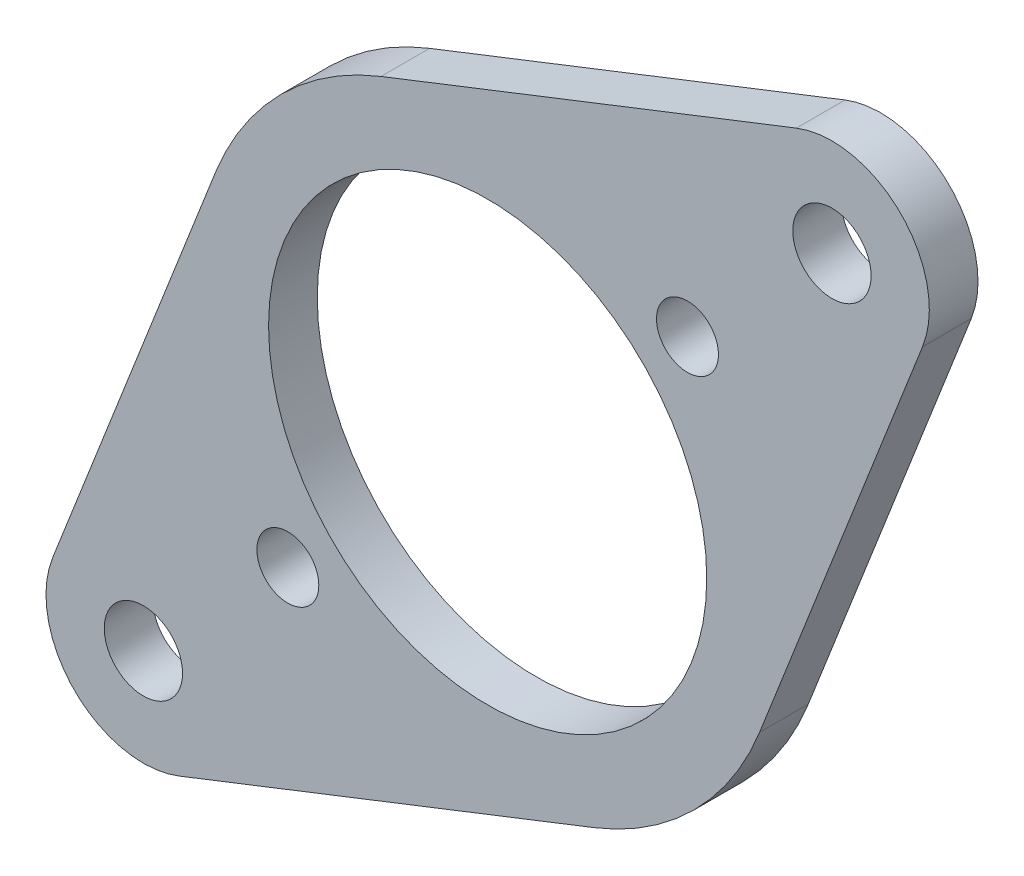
ISO-10303-21;
HEADER;
FILE_DESCRIPTION(('STEP AP214'),'2;1');
FILE_NAME('part.step','',(''),(''),'','','');
FILE_SCHEMA(('AUTOMOTIVE_DESIGN { 1 0 10303 214 1 1 1 1 }'));
ENDSEC;
DATA;
#1=APPLICATION_CONTEXT('core data for automotive mechanical design processes');
#2=APPLICATION_PROTOCOL_DEFINITION('international standard','automotive_design',2000,#1);
#3=PRODUCT_CONTEXT('',#1,'mechanical');
#4=PRODUCT('Part','Part','',(#3));
#5=PRODUCT_RELATED_PRODUCT_CATEGORY('part','',(#4));
#6=PRODUCT_DEFINITION_FORMATION('','',#4);
#7=PRODUCT_DEFINITION_CONTEXT('part definition',#1,'design');
#8=PRODUCT_DEFINITION('design','',#6,#7);
#9=PRODUCT_DEFINITION_SHAPE('','',#8);
#10=(LENGTH_UNIT() NAMED_UNIT(*) SI_UNIT(.MILLI.,.METRE.));
#11=(NAMED_UNIT(*) PLANE_ANGLE_UNIT() SI_UNIT($,.RADIAN.));
#12=(NAMED_UNIT(*) SI_UNIT($,.STERADIAN.) SOLID_ANGLE_UNIT());
#13=UNCERTAINTY_MEASURE_WITH_UNIT(LENGTH_MEASURE(1.E-05),#10,'distance_accuracy_value','');
#14=(GEOMETRIC_REPRESENTATION_CONTEXT(3) GLOBAL_UNCERTAINTY_ASSIGNED_CONTEXT((#13)) GLOBAL_UNIT_ASSIGNED_CONTEXT((#10,
#11,#12)) REPRESENTATION_CONTEXT('',''));
#15=CARTESIAN_POINT('',(0.,0.,0.));
#16=DIRECTION('',(0.,0.,1.));
#17=DIRECTION('',(1.,0.,0.));
#18=AXIS2_PLACEMENT_3D('',#15,#16,#17);
#19=CARTESIAN_POINT('',(0.,0.,3.175));
#20=DIRECTION('',(0.,0.,1.));
#21=DIRECTION('',(1.,0.,0.));
#22=AXIS2_PLACEMENT_3D('',#19,#20,#21);
#23=PLANE('',#22);
#24=CARTESIAN_POINT('',(-13.0303516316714,-13.0303516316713,3.175));
#25=DIRECTION('',(0.,0.,1.));
#26=DIRECTION('',(1.,0.,0.));
#27=AXIS2_PLACEMENT_3D('',#24,#25,#26);
#28=CIRCLE('',#27,2.0193);
#29=CARTESIAN_POINT('',(-11.0110516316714,-13.0303516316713,3.175));
#30=VERTEX_POINT('',#29);
#31=EDGE_CURVE('E193',#30,#30,#28,.T.);
#32=ORIENTED_EDGE('',*,*,#31,.F.);
#33=EDGE_LOOP('',(#32));
#34=FACE_BOUND('',#33,.T.);
#35=CARTESIAN_POINT('',(22.450640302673,22.4506403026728,3.175));
#36=DIRECTION('',(0.,0.,1.));
#37=DIRECTION('',(1.,0.,0.));
#38=AXIS2_PLACEMENT_3D('',#35,#36,#37);
#39=CIRCLE('',#38,2.5527);
#40=CARTESIAN_POINT('',(25.003340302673,22.4506403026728,3.175));
#41=VERTEX_POINT('',#40);
#42=EDGE_CURVE('E181',#41,#41,#39,.T.);
#43=ORIENTED_EDGE('',*,*,#42,.F.);
#44=EDGE_LOOP('',(#43));
#45=FACE_BOUND('',#44,.T.);
#46=CARTESIAN_POINT('',(0.,0.,3.175));
#47=DIRECTION('',(0.,0.,1.));
#48=DIRECTION('',(1.,0.,0.));
#49=AXIS2_PLACEMENT_3D('',#46,#47,#48);
#50=CIRCLE('',#49,19.05);
#51=CARTESIAN_POINT('',(6.9576573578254,-17.7339647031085,3.175));
#52=VERTEX_POINT('',#51);
#53=CARTESIAN_POINT('',(17.7339647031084,-6.95765735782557,3.175));
#54=VERTEX_POINT('',#53);
#55=EDGE_CURVE('E144',#52,#54,#50,.T.);
#56=ORIENTED_EDGE('',*,*,#55,.T.);
#57=DIRECTION('',(0.365231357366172,0.930916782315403,0.));
#58=VECTOR('',#57,1.);
#59=CARTESIAN_POINT('',(28.3619618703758,20.1314211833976,3.175));
#60=LINE('',#59,#58);
#61=CARTESIAN_POINT('',(28.3619618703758,20.1314211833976,3.175));
#62=VERTEX_POINT('',#61);
#63=EDGE_CURVE('E92',#54,#62,#60,.T.);
#64=ORIENTED_EDGE('',*,*,#63,.T.);
#65=CARTESIAN_POINT('',(22.450640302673,22.4506403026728,3.175));
#66=DIRECTION('',(0.,0.,1.));
#67=DIRECTION('',(1.,0.,0.));
#68=AXIS2_PLACEMENT_3D('',#65,#66,#67);
#69=CIRCLE('',#68,6.35);
#70=CARTESIAN_POINT('',(20.1314211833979,28.3619618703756,3.175));
#71=VERTEX_POINT('',#70);
#72=EDGE_CURVE('E159',#62,#71,#69,.T.);
#73=ORIENTED_EDGE('',*,*,#72,.T.);
#74=DIRECTION('',(-0.930916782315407,-0.365231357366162,0.));
#75=VECTOR('',#74,1.);
#76=CARTESIAN_POINT('',(-6.95765735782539,17.7339647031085,3.175));
#77=LINE('',#76,#75);
#78=CARTESIAN_POINT('',(-6.95765735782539,17.7339647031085,3.175));
#79=VERTEX_POINT('',#78);
#80=EDGE_CURVE('E172',#71,#79,#77,.T.);
#81=ORIENTED_EDGE('',*,*,#80,.T.);
#82=CARTESIAN_POINT('',(0.,0.,3.175));
#83=DIRECTION('',(0.,0.,1.));
#84=DIRECTION('',(1.,0.,0.));
#85=AXIS2_PLACEMENT_3D('',#82,#83,#84);
#86=CIRCLE('',#85,19.05);
#87=CARTESIAN_POINT('',(-17.7339647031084,6.95765735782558,3.175));
#88=VERTEX_POINT('',#87);
#89=EDGE_CURVE('E111',#79,#88,#86,.T.);
#90=ORIENTED_EDGE('',*,*,#89,.T.);
#91=DIRECTION('',(-0.365231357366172,-0.930916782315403,0.));
#92=VECTOR('',#91,1.);
#93=CARTESIAN_POINT('',(-17.7339647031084,6.95765735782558,3.175));
#94=LINE('',#93,#92);
#95=CARTESIAN_POINT('',(-28.3619618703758,-20.1314211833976,3.175));
#96=VERTEX_POINT('',#95);
#97=EDGE_CURVE('E105',#88,#96,#94,.T.);
#98=ORIENTED_EDGE('',*,*,#97,.T.);
#99=CARTESIAN_POINT('',(-22.450640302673,-22.4506403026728,3.175));
#100=DIRECTION('',(0.,0.,1.));
#101=DIRECTION('',(1.,0.,0.));
#102=AXIS2_PLACEMENT_3D('',#99,#100,#101);
#103=CIRCLE('',#102,6.35000000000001);
#104=CARTESIAN_POINT('',(-20.1314211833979,-28.3619618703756,3.175));
#105=VERTEX_POINT('',#104);
#106=EDGE_CURVE('E109',#96,#105,#103,.T.);
#107=ORIENTED_EDGE('',*,*,#106,.T.);
#108=DIRECTION('',(0.930916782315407,0.365231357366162,0.));
#109=VECTOR('',#108,1.);
#110=CARTESIAN_POINT('',(-20.1314211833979,-28.3619618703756,3.175));
#111=LINE('',#110,#109);
#112=EDGE_CURVE('E49',#105,#52,#111,.T.);
#113=ORIENTED_EDGE('',*,*,#112,.T.);
#114=EDGE_LOOP('',(#56,#64,#73,#81,#90,#98,#107,#113));
#115=FACE_BOUND('',#114,.T.);
#116=CARTESIAN_POINT('',(0.,0.,3.175));
#117=DIRECTION('',(0.,0.,1.));
#118=DIRECTION('',(1.,0.,0.));
#119=AXIS2_PLACEMENT_3D('',#116,#117,#118);
#120=CIRCLE('',#119,14.2875);
#121=CARTESIAN_POINT('',(14.2875,0.,3.175));
#122=VERTEX_POINT('',#121);
#123=EDGE_CURVE('E133',#122,#122,#120,.T.);
#124=ORIENTED_EDGE('',*,*,#123,.F.);
#125=EDGE_LOOP('',(#124));
#126=FACE_BOUND('',#125,.T.);
#127=CARTESIAN_POINT('',(-22.450640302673,-22.4506403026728,3.175));
#128=DIRECTION('',(0.,0.,1.));
#129=DIRECTION('',(1.,0.,0.));
#130=AXIS2_PLACEMENT_3D('',#127,#128,#129);
#131=CIRCLE('',#130,2.5527);
#132=CARTESIAN_POINT('',(-19.897940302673,-22.4506403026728,3.175));
#133=VERTEX_POINT('',#132);
#134=EDGE_CURVE('E187',#133,#133,#131,.T.);
#135=ORIENTED_EDGE('',*,*,#134,.F.);
#136=EDGE_LOOP('',(#135));
#137=FACE_BOUND('',#136,.T.);
#138=CARTESIAN_POINT('',(13.0303516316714,13.0303516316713,3.175));
#139=DIRECTION('',(0.,0.,1.));
#140=DIRECTION('',(1.,0.,0.));
#141=AXIS2_PLACEMENT_3D('',#138,#139,#140);
#142=CIRCLE('',#141,2.0193);
#143=CARTESIAN_POINT('',(15.0496516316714,13.0303516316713,3.175));
#144=VERTEX_POINT('',#143);
#145=EDGE_CURVE('E199',#144,#144,#142,.T.);
#146=ORIENTED_EDGE('',*,*,#145,.F.);
#147=EDGE_LOOP('',(#146));
#148=FACE_BOUND('',#147,.T.);
#149=ADVANCED_FACE('F32',(#34,#45,#115,#126,#137,#148),#23,.T.);
#150=CARTESIAN_POINT('',(0.,0.,0.));
#151=DIRECTION('',(0.,0.,1.));
#152=DIRECTION('',(1.,0.,0.));
#153=AXIS2_PLACEMENT_3D('',#150,#151,#152);
#154=PLANE('',#153);
#155=CARTESIAN_POINT('',(0.,0.,0.));
#156=DIRECTION('',(0.,0.,1.));
#157=DIRECTION('',(1.,0.,0.));
#158=AXIS2_PLACEMENT_3D('',#155,#156,#157);
#159=CIRCLE('',#158,19.05);
#160=CARTESIAN_POINT('',(6.9576573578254,-17.7339647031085,0.));
#161=VERTEX_POINT('',#160);
#162=CARTESIAN_POINT('',(17.7339647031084,-6.95765735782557,0.));
#163=VERTEX_POINT('',#162);
#164=EDGE_CURVE('E129',#161,#163,#159,.T.);
#165=ORIENTED_EDGE('',*,*,#164,.F.);
#166=DIRECTION('',(0.930916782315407,0.365231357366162,0.));
#167=VECTOR('',#166,1.);
#168=CARTESIAN_POINT('',(-20.1314211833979,-28.3619618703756,0.));
#169=LINE('',#168,#167);
#170=CARTESIAN_POINT('',(-20.1314211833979,-28.3619618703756,0.));
#171=VERTEX_POINT('',#170);
#172=EDGE_CURVE('E84',#171,#161,#169,.T.);
#173=ORIENTED_EDGE('',*,*,#172,.F.);
#174=CARTESIAN_POINT('',(-22.450640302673,-22.4506403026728,0.));
#175=DIRECTION('',(0.,0.,1.));
#176=DIRECTION('',(1.,0.,0.));
#177=AXIS2_PLACEMENT_3D('',#174,#175,#176);
#178=CIRCLE('',#177,6.35000000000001);
#179=CARTESIAN_POINT('',(-28.3619618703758,-20.1314211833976,0.));
#180=VERTEX_POINT('',#179);
#181=EDGE_CURVE('E78',#180,#171,#178,.T.);
#182=ORIENTED_EDGE('',*,*,#181,.F.);
#183=DIRECTION('',(-0.365231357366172,-0.930916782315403,0.));
#184=VECTOR('',#183,1.);
#185=CARTESIAN_POINT('',(-17.7339647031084,6.95765735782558,0.));
#186=LINE('',#185,#184);
#187=CARTESIAN_POINT('',(-17.7339647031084,6.95765735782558,0.));
#188=VERTEX_POINT('',#187);
#189=EDGE_CURVE('E119',#188,#180,#186,.T.);
#190=ORIENTED_EDGE('',*,*,#189,.F.);
#191=CARTESIAN_POINT('',(0.,0.,0.));
#192=DIRECTION('',(0.,0.,1.));
#193=DIRECTION('',(1.,0.,0.));
#194=AXIS2_PLACEMENT_3D('',#191,#192,#193);
#195=CIRCLE('',#194,19.05);
#196=CARTESIAN_POINT('',(-6.95765735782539,17.7339647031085,0.));
#197=VERTEX_POINT('',#196);
#198=EDGE_CURVE('E139',#197,#188,#195,.T.);
#199=ORIENTED_EDGE('',*,*,#198,.F.);
#200=DIRECTION('',(-0.930916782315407,-0.365231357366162,0.));
#201=VECTOR('',#200,1.);
#202=CARTESIAN_POINT('',(-6.95765735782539,17.7339647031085,0.));
#203=LINE('',#202,#201);
#204=CARTESIAN_POINT('',(20.1314211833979,28.3619618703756,0.));
#205=VERTEX_POINT('',#204);
#206=EDGE_CURVE('E137',#205,#197,#203,.T.);
#207=ORIENTED_EDGE('',*,*,#206,.F.);
#208=CARTESIAN_POINT('',(22.450640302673,22.4506403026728,0.));
#209=DIRECTION('',(0.,0.,1.));
#210=DIRECTION('',(1.,0.,0.));
#211=AXIS2_PLACEMENT_3D('',#208,#209,#210);
#212=CIRCLE('',#211,6.35);
#213=CARTESIAN_POINT('',(28.3619618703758,20.1314211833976,0.));
#214=VERTEX_POINT('',#213);
#215=EDGE_CURVE('E135',#214,#205,#212,.T.);
#216=ORIENTED_EDGE('',*,*,#215,.F.);
#217=DIRECTION('',(0.365231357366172,0.930916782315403,0.));
#218=VECTOR('',#217,1.);
#219=CARTESIAN_POINT('',(28.3619618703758,20.1314211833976,0.));
#220=LINE('',#219,#218);
#221=EDGE_CURVE('E132',#163,#214,#220,.T.);
#222=ORIENTED_EDGE('',*,*,#221,.F.);
#223=EDGE_LOOP('',(#165,#173,#182,#190,#199,#207,#216,#222));
#224=FACE_BOUND('',#223,.T.);
#225=CARTESIAN_POINT('',(0.,0.,0.));
#226=DIRECTION('',(0.,0.,1.));
#227=DIRECTION('',(1.,0.,0.));
#228=AXIS2_PLACEMENT_3D('',#225,#226,#227);
#229=CIRCLE('',#228,14.2875);
#230=CARTESIAN_POINT('',(14.2875,0.,0.));
#231=VERTEX_POINT('',#230);
#232=EDGE_CURVE('E178',#231,#231,#229,.T.);
#233=ORIENTED_EDGE('',*,*,#232,.T.);
#234=EDGE_LOOP('',(#233));
#235=FACE_BOUND('',#234,.T.);
#236=CARTESIAN_POINT('',(22.450640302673,22.4506403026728,0.));
#237=DIRECTION('',(0.,0.,1.));
#238=DIRECTION('',(1.,0.,0.));
#239=AXIS2_PLACEMENT_3D('',#236,#237,#238);
#240=CIRCLE('',#239,2.5527);
#241=CARTESIAN_POINT('',(25.003340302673,22.4506403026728,0.));
#242=VERTEX_POINT('',#241);
#243=EDGE_CURVE('E184',#242,#242,#240,.T.);
#244=ORIENTED_EDGE('',*,*,#243,.T.);
#245=EDGE_LOOP('',(#244));
#246=FACE_BOUND('',#245,.T.);
#247=CARTESIAN_POINT('',(-22.450640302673,-22.4506403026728,0.));
#248=DIRECTION('',(0.,0.,1.));
#249=DIRECTION('',(1.,0.,0.));
#250=AXIS2_PLACEMENT_3D('',#247,#248,#249);
#251=CIRCLE('',#250,2.5527);
#252=CARTESIAN_POINT('',(-19.897940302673,-22.4506403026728,0.));
#253=VERTEX_POINT('',#252);
#254=EDGE_CURVE('E190',#253,#253,#251,.T.);
#255=ORIENTED_EDGE('',*,*,#254,.T.);
#256=EDGE_LOOP('',(#255));
#257=FACE_BOUND('',#256,.T.);
#258=CARTESIAN_POINT('',(-13.0303516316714,-13.0303516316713,0.));
#259=DIRECTION('',(0.,0.,1.));
#260=DIRECTION('',(1.,0.,0.));
#261=AXIS2_PLACEMENT_3D('',#258,#259,#260);
#262=CIRCLE('',#261,2.0193);
#263=CARTESIAN_POINT('',(-11.0110516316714,-13.0303516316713,0.));
#264=VERTEX_POINT('',#263);
#265=EDGE_CURVE('E196',#264,#264,#262,.T.);
#266=ORIENTED_EDGE('',*,*,#265,.T.);
#267=EDGE_LOOP('',(#266));
#268=FACE_BOUND('',#267,.T.);
#269=CARTESIAN_POINT('',(13.0303516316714,13.0303516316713,0.));
#270=DIRECTION('',(0.,0.,1.));
#271=DIRECTION('',(1.,0.,0.));
#272=AXIS2_PLACEMENT_3D('',#269,#270,#271);
#273=CIRCLE('',#272,2.0193);
#274=CARTESIAN_POINT('',(15.0496516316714,13.0303516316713,0.));
#275=VERTEX_POINT('',#274);
#276=EDGE_CURVE('E202',#275,#275,#273,.T.);
#277=ORIENTED_EDGE('',*,*,#276,.T.);
#278=EDGE_LOOP('',(#277));
#279=FACE_BOUND('',#278,.T.);
#280=ADVANCED_FACE('F163',(#224,#235,#246,#257,#268,#279),#154,.F.);
#281=CARTESIAN_POINT('',(0.,0.,3.175));
#282=DIRECTION('',(0.,0.,-1.));
#283=DIRECTION('',(-1.,0.,0.));
#284=AXIS2_PLACEMENT_3D('',#281,#282,#283);
#285=CYLINDRICAL_SURFACE('',#284,19.05);
#286=ORIENTED_EDGE('',*,*,#164,.T.);
#287=DIRECTION('',(0.,0.,-1.));
#288=VECTOR('',#287,1.);
#289=CARTESIAN_POINT('',(17.7339647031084,-6.95765735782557,3.175));
#290=LINE('',#289,#288);
#291=EDGE_CURVE('E11',#54,#163,#290,.T.);
#292=ORIENTED_EDGE('',*,*,#291,.F.);
#293=ORIENTED_EDGE('',*,*,#55,.F.);
#294=DIRECTION('',(0.,0.,-1.));
#295=VECTOR('',#294,1.);
#296=CARTESIAN_POINT('',(6.9576573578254,-17.7339647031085,3.175));
#297=LINE('',#296,#295);
#298=EDGE_CURVE('E125',#52,#161,#297,.T.);
#299=ORIENTED_EDGE('',*,*,#298,.T.);
#300=EDGE_LOOP('',(#286,#292,#293,#299));
#301=FACE_BOUND('',#300,.T.);
#302=ADVANCED_FACE('F34',(#301),#285,.T.);
#303=CARTESIAN_POINT('',(28.3619618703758,20.1314211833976,3.175));
#304=DIRECTION('',(-0.930916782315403,0.365231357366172,0.));
#305=DIRECTION('',(-0.365231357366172,-0.930916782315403,0.));
#306=AXIS2_PLACEMENT_3D('',#303,#304,#305);
#307=PLANE('',#306);
#308=ORIENTED_EDGE('',*,*,#221,.T.);
#309=DIRECTION('',(0.,0.,-1.));
#310=VECTOR('',#309,1.);
#311=CARTESIAN_POINT('',(28.3619618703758,20.1314211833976,3.175));
#312=LINE('',#311,#310);
#313=EDGE_CURVE('E41',#62,#214,#312,.T.);
#314=ORIENTED_EDGE('',*,*,#313,.F.);
#315=ORIENTED_EDGE('',*,*,#63,.F.);
#316=ORIENTED_EDGE('',*,*,#291,.T.);
#317=EDGE_LOOP('',(#308,#314,#315,#316));
#318=FACE_BOUND('',#317,.T.);
#319=ADVANCED_FACE('F236',(#318),#307,.F.);
#320=CARTESIAN_POINT('',(22.450640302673,22.4506403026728,3.175));
#321=DIRECTION('',(0.,0.,-1.));
#322=DIRECTION('',(-1.,0.,0.));
#323=AXIS2_PLACEMENT_3D('',#320,#321,#322);
#324=CYLINDRICAL_SURFACE('',#323,6.35);
#325=ORIENTED_EDGE('',*,*,#215,.T.);
#326=DIRECTION('',(0.,0.,-1.));
#327=VECTOR('',#326,1.);
#328=CARTESIAN_POINT('',(20.1314211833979,28.3619618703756,3.175));
#329=LINE('',#328,#327);
#330=EDGE_CURVE('E151',#71,#205,#329,.T.);
#331=ORIENTED_EDGE('',*,*,#330,.F.);
#332=ORIENTED_EDGE('',*,*,#72,.F.);
#333=ORIENTED_EDGE('',*,*,#313,.T.);
#334=EDGE_LOOP('',(#325,#331,#332,#333));
#335=FACE_BOUND('',#334,.T.);
#336=ADVANCED_FACE('F157',(#335),#324,.T.);
#337=CARTESIAN_POINT('',(-6.95765735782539,17.7339647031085,3.175));
#338=DIRECTION('',(0.365231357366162,-0.930916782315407,0.));
#339=DIRECTION('',(0.930916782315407,0.365231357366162,0.));
#340=AXIS2_PLACEMENT_3D('',#337,#338,#339);
#341=PLANE('',#340);
#342=ORIENTED_EDGE('',*,*,#206,.T.);
#343=DIRECTION('',(0.,0.,-1.));
#344=VECTOR('',#343,1.);
#345=CARTESIAN_POINT('',(-6.95765735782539,17.7339647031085,3.175));
#346=LINE('',#345,#344);
#347=EDGE_CURVE('E148',#79,#197,#346,.T.);
#348=ORIENTED_EDGE('',*,*,#347,.F.);
#349=ORIENTED_EDGE('',*,*,#80,.F.);
#350=ORIENTED_EDGE('',*,*,#330,.T.);
#351=EDGE_LOOP('',(#342,#348,#349,#350));
#352=FACE_BOUND('',#351,.T.);
#353=ADVANCED_FACE('F168',(#352),#341,.F.);
#354=CARTESIAN_POINT('',(0.,0.,3.175));
#355=DIRECTION('',(0.,0.,-1.));
#356=DIRECTION('',(-1.,0.,0.));
#357=AXIS2_PLACEMENT_3D('',#354,#355,#356);
#358=CYLINDRICAL_SURFACE('',#357,19.05);
#359=ORIENTED_EDGE('',*,*,#198,.T.);
#360=DIRECTION('',(0.,0.,-1.));
#361=VECTOR('',#360,1.);
#362=CARTESIAN_POINT('',(-17.7339647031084,6.95765735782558,3.175));
#363=LINE('',#362,#361);
#364=EDGE_CURVE('E120',#88,#188,#363,.T.);
#365=ORIENTED_EDGE('',*,*,#364,.F.);
#366=ORIENTED_EDGE('',*,*,#89,.F.);
#367=ORIENTED_EDGE('',*,*,#347,.T.);
#368=EDGE_LOOP('',(#359,#365,#366,#367));
#369=FACE_BOUND('',#368,.T.);
#370=ADVANCED_FACE('F171',(#369),#358,.T.);
#371=CARTESIAN_POINT('',(-17.7339647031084,6.95765735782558,3.175));
#372=DIRECTION('',(0.930916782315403,-0.365231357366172,0.));
#373=DIRECTION('',(0.365231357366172,0.930916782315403,0.));
#374=AXIS2_PLACEMENT_3D('',#371,#372,#373);
#375=PLANE('',#374);
#376=ORIENTED_EDGE('',*,*,#189,.T.);
#377=DIRECTION('',(0.,0.,-1.));
#378=VECTOR('',#377,1.);
#379=CARTESIAN_POINT('',(-28.3619618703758,-20.1314211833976,3.175));
#380=LINE('',#379,#378);
#381=EDGE_CURVE('E116',#96,#180,#380,.T.);
#382=ORIENTED_EDGE('',*,*,#381,.F.);
#383=ORIENTED_EDGE('',*,*,#97,.F.);
#384=ORIENTED_EDGE('',*,*,#364,.T.);
#385=EDGE_LOOP('',(#376,#382,#383,#384));
#386=FACE_BOUND('',#385,.T.);
#387=ADVANCED_FACE('F117',(#386),#375,.F.);
#388=CARTESIAN_POINT('',(-22.450640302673,-22.4506403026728,3.175));
#389=DIRECTION('',(0.,0.,-1.));
#390=DIRECTION('',(-1.,0.,0.));
#391=AXIS2_PLACEMENT_3D('',#388,#389,#390);
#392=CYLINDRICAL_SURFACE('',#391,6.35000000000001);
#393=ORIENTED_EDGE('',*,*,#181,.T.);
#394=DIRECTION('',(0.,0.,-1.));
#395=VECTOR('',#394,1.);
#396=CARTESIAN_POINT('',(-20.1314211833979,-28.3619618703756,3.175));
#397=LINE('',#396,#395);
#398=EDGE_CURVE('E121',#105,#171,#397,.T.);
#399=ORIENTED_EDGE('',*,*,#398,.F.);
#400=ORIENTED_EDGE('',*,*,#106,.F.);
#401=ORIENTED_EDGE('',*,*,#381,.T.);
#402=EDGE_LOOP('',(#393,#399,#400,#401));
#403=FACE_BOUND('',#402,.T.);
#404=ADVANCED_FACE('F123',(#403),#392,.T.);
#405=CARTESIAN_POINT('',(-20.1314211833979,-28.3619618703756,3.175));
#406=DIRECTION('',(-0.365231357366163,0.930916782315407,0.));
#407=DIRECTION('',(-0.930916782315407,-0.365231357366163,0.));
#408=AXIS2_PLACEMENT_3D('',#405,#406,#407);
#409=PLANE('',#408);
#410=ORIENTED_EDGE('',*,*,#172,.T.);
#411=ORIENTED_EDGE('',*,*,#298,.F.);
#412=ORIENTED_EDGE('',*,*,#112,.F.);
#413=ORIENTED_EDGE('',*,*,#398,.T.);
#414=EDGE_LOOP('',(#410,#411,#412,#413));
#415=FACE_BOUND('',#414,.T.);
#416=ADVANCED_FACE('F224',(#415),#409,.F.);
#417=CARTESIAN_POINT('',(0.,0.,3.175));
#418=DIRECTION('',(0.,0.,-1.));
#419=DIRECTION('',(-1.,0.,0.));
#420=AXIS2_PLACEMENT_3D('',#417,#418,#419);
#421=CYLINDRICAL_SURFACE('',#420,14.2875);
#422=ORIENTED_EDGE('',*,*,#123,.T.);
#423=EDGE_LOOP('',(#422));
#424=FACE_BOUND('',#423,.T.);
#425=ORIENTED_EDGE('',*,*,#232,.F.);
#426=EDGE_LOOP('',(#425));
#427=FACE_BOUND('',#426,.T.);
#428=ADVANCED_FACE('F221',(#424,#427),#421,.F.);
#429=CARTESIAN_POINT('',(22.450640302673,22.4506403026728,3.175));
#430=DIRECTION('',(0.,0.,-1.));
#431=DIRECTION('',(-1.,0.,0.));
#432=AXIS2_PLACEMENT_3D('',#429,#430,#431);
#433=CYLINDRICAL_SURFACE('',#432,2.5527);
#434=ORIENTED_EDGE('',*,*,#42,.T.);
#435=EDGE_LOOP('',(#434));
#436=FACE_BOUND('',#435,.T.);
#437=ORIENTED_EDGE('',*,*,#243,.F.);
#438=EDGE_LOOP('',(#437));
#439=FACE_BOUND('',#438,.T.);
#440=ADVANCED_FACE('F300',(#436,#439),#433,.F.);
#441=CARTESIAN_POINT('',(-22.450640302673,-22.4506403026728,3.175));
#442=DIRECTION('',(0.,0.,-1.));
#443=DIRECTION('',(-1.,0.,0.));
#444=AXIS2_PLACEMENT_3D('',#441,#442,#443);
#445=CYLINDRICAL_SURFACE('',#444,2.5527);
#446=ORIENTED_EDGE('',*,*,#134,.T.);
#447=EDGE_LOOP('',(#446));
#448=FACE_BOUND('',#447,.T.);
#449=ORIENTED_EDGE('',*,*,#254,.F.);
#450=EDGE_LOOP('',(#449));
#451=FACE_BOUND('',#450,.T.);
#452=ADVANCED_FACE('F308',(#448,#451),#445,.F.);
#453=CARTESIAN_POINT('',(-13.0303516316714,-13.0303516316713,3.175));
#454=DIRECTION('',(0.,0.,-1.));
#455=DIRECTION('',(-1.,0.,0.));
#456=AXIS2_PLACEMENT_3D('',#453,#454,#455);
#457=CYLINDRICAL_SURFACE('',#456,2.0193);
#458=ORIENTED_EDGE('',*,*,#31,.T.);
#459=EDGE_LOOP('',(#458));
#460=FACE_BOUND('',#459,.T.);
#461=ORIENTED_EDGE('',*,*,#265,.F.);
#462=EDGE_LOOP('',(#461));
#463=FACE_BOUND('',#462,.T.);
#464=ADVANCED_FACE('F316',(#460,#463),#457,.F.);
#465=CARTESIAN_POINT('',(13.0303516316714,13.0303516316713,3.175));
#466=DIRECTION('',(0.,0.,-1.));
#467=DIRECTION('',(-1.,0.,0.));
#468=AXIS2_PLACEMENT_3D('',#465,#466,#467);
#469=CYLINDRICAL_SURFACE('',#468,2.0193);
#470=ORIENTED_EDGE('',*,*,#145,.T.);
#471=EDGE_LOOP('',(#470));
#472=FACE_BOUND('',#471,.T.);
#473=ORIENTED_EDGE('',*,*,#276,.F.);
#474=EDGE_LOOP('',(#473));
#475=FACE_BOUND('',#474,.T.);
#476=ADVANCED_FACE('F208',(#472,#475),#469,.F.);
#477=CLOSED_SHELL('',(#149,#280,#302,#319,#336,#353,#370,#387,#404,#416,#428,#440,#452,#464,#476));
#478=MANIFOLD_SOLID_BREP('B2',#477);
#479=ADVANCED_BREP_SHAPE_REPRESENTATION('',(#18,#478),#14);
#480=SHAPE_DEFINITION_REPRESENTATION(#9,#479);
ENDSEC;
END-ISO-10303-21;
